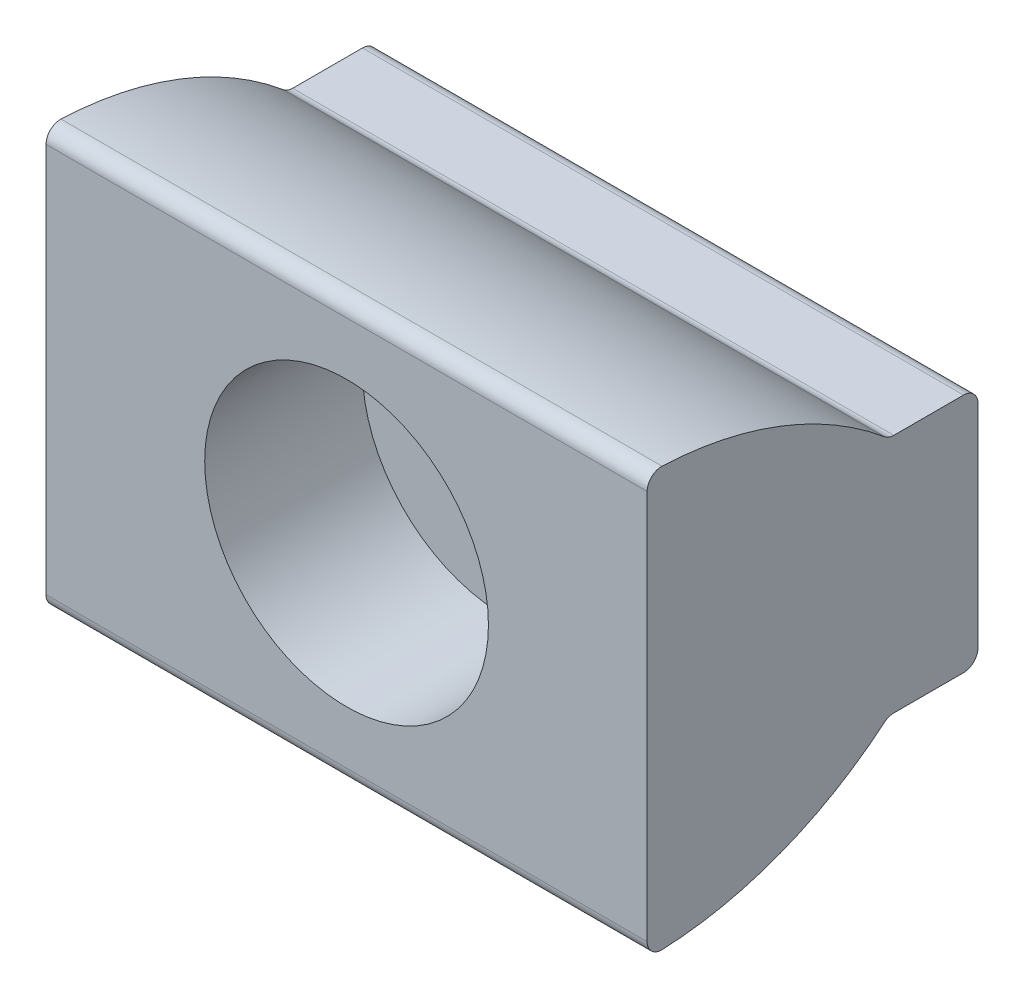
ISO-10303-21;
HEADER;
FILE_DESCRIPTION(('STEP AP214'),'2;1');
FILE_NAME('part.step','',(''),(''),'','','');
FILE_SCHEMA(('AUTOMOTIVE_DESIGN { 1 0 10303 214 1 1 1 1 }'));
ENDSEC;
DATA;
#1=APPLICATION_CONTEXT('core data for automotive mechanical design processes');
#2=APPLICATION_PROTOCOL_DEFINITION('international standard','automotive_design',2000,#1);
#3=PRODUCT_CONTEXT('',#1,'mechanical');
#4=PRODUCT('Part','Part','',(#3));
#5=PRODUCT_RELATED_PRODUCT_CATEGORY('part','',(#4));
#6=PRODUCT_DEFINITION_FORMATION('','',#4);
#7=PRODUCT_DEFINITION_CONTEXT('part definition',#1,'design');
#8=PRODUCT_DEFINITION('design','',#6,#7);
#9=PRODUCT_DEFINITION_SHAPE('','',#8);
#10=(LENGTH_UNIT() NAMED_UNIT(*) SI_UNIT(.MILLI.,.METRE.));
#11=(NAMED_UNIT(*) PLANE_ANGLE_UNIT() SI_UNIT($,.RADIAN.));
#12=(NAMED_UNIT(*) SI_UNIT($,.STERADIAN.) SOLID_ANGLE_UNIT());
#13=UNCERTAINTY_MEASURE_WITH_UNIT(LENGTH_MEASURE(1.E-05),#10,'distance_accuracy_value','');
#14=(GEOMETRIC_REPRESENTATION_CONTEXT(3) GLOBAL_UNCERTAINTY_ASSIGNED_CONTEXT((#13)) GLOBAL_UNIT_ASSIGNED_CONTEXT((#10,
#11,#12)) REPRESENTATION_CONTEXT('',''));
#15=CARTESIAN_POINT('',(0.,0.,0.));
#16=DIRECTION('',(0.,0.,1.));
#17=DIRECTION('',(1.,0.,0.));
#18=AXIS2_PLACEMENT_3D('',#15,#16,#17);
#19=CARTESIAN_POINT('',(7.9375,-2.794,0.));
#20=DIRECTION('',(0.,0.,1.));
#21=DIRECTION('',(1.,0.,0.));
#22=AXIS2_PLACEMENT_3D('',#19,#20,#21);
#23=PLANE('',#22);
#24=DIRECTION('',(0.,1.,0.));
#25=VECTOR('',#24,1.);
#26=CARTESIAN_POINT('',(-7.9375,-2.794,0.));
#27=LINE('',#26,#25);
#28=CARTESIAN_POINT('',(-7.9375,-2.794,0.));
#29=VERTEX_POINT('',#28);
#30=CARTESIAN_POINT('',(-7.9375,2.794,0.));
#31=VERTEX_POINT('',#30);
#32=EDGE_CURVE('E135',#29,#31,#27,.T.);
#33=ORIENTED_EDGE('',*,*,#32,.T.);
#34=DIRECTION('',(-1.,0.,0.));
#35=VECTOR('',#34,1.);
#36=CARTESIAN_POINT('',(7.9375,2.794,0.));
#37=LINE('',#36,#35);
#38=CARTESIAN_POINT('',(7.9375,2.794,0.));
#39=VERTEX_POINT('',#38);
#40=EDGE_CURVE('E186',#39,#31,#37,.T.);
#41=ORIENTED_EDGE('',*,*,#40,.F.);
#42=DIRECTION('',(0.,1.,0.));
#43=VECTOR('',#42,1.);
#44=CARTESIAN_POINT('',(7.9375,-2.794,0.));
#45=LINE('',#44,#43);
#46=CARTESIAN_POINT('',(7.9375,-2.794,0.));
#47=VERTEX_POINT('',#46);
#48=EDGE_CURVE('E158',#47,#39,#45,.T.);
#49=ORIENTED_EDGE('',*,*,#48,.F.);
#50=DIRECTION('',(-1.,0.,0.));
#51=VECTOR('',#50,1.);
#52=CARTESIAN_POINT('',(7.9375,-2.794,0.));
#53=LINE('',#52,#51);
#54=EDGE_CURVE('E189',#47,#29,#53,.T.);
#55=ORIENTED_EDGE('',*,*,#54,.T.);
#56=EDGE_LOOP('',(#33,#41,#49,#55));
#57=FACE_BOUND('',#56,.T.);
#58=CARTESIAN_POINT('',(0.,0.,0.));
#59=DIRECTION('',(0.,0.,1.));
#60=DIRECTION('',(1.,0.,0.));
#61=AXIS2_PLACEMENT_3D('',#58,#59,#60);
#62=CIRCLE('',#61,2.1209);
#63=CARTESIAN_POINT('',(2.1209,0.,0.));
#64=VERTEX_POINT('',#63);
#65=EDGE_CURVE('E18',#64,#64,#62,.F.);
#66=ORIENTED_EDGE('',*,*,#65,.F.);
#67=EDGE_LOOP('',(#66));
#68=FACE_BOUND('',#67,.T.);
#69=ADVANCED_FACE('F14',(#57,#68),#23,.F.);
#70=CARTESIAN_POINT('',(7.9375,-5.14847834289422,8.7376));
#71=DIRECTION('',(0.,0.,-1.));
#72=DIRECTION('',(-1.,0.,0.));
#73=AXIS2_PLACEMENT_3D('',#70,#71,#72);
#74=PLANE('',#73);
#75=DIRECTION('',(0.,-1.,0.));
#76=VECTOR('',#75,1.);
#77=CARTESIAN_POINT('',(-7.9375,-5.14847834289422,8.7376));
#78=LINE('',#77,#76);
#79=CARTESIAN_POINT('',(-7.9375,5.14847834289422,8.7376));
#80=VERTEX_POINT('',#79);
#81=CARTESIAN_POINT('',(-7.9375,-5.14847834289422,8.7376));
#82=VERTEX_POINT('',#81);
#83=EDGE_CURVE('E147',#80,#82,#78,.T.);
#84=ORIENTED_EDGE('',*,*,#83,.T.);
#85=DIRECTION('',(-1.,0.,0.));
#86=VECTOR('',#85,1.);
#87=CARTESIAN_POINT('',(7.9375,-5.14847834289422,8.7376));
#88=LINE('',#87,#86);
#89=CARTESIAN_POINT('',(7.9375,-5.14847834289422,8.7376));
#90=VERTEX_POINT('',#89);
#91=EDGE_CURVE('E122',#90,#82,#88,.T.);
#92=ORIENTED_EDGE('',*,*,#91,.F.);
#93=DIRECTION('',(0.,-1.,0.));
#94=VECTOR('',#93,1.);
#95=CARTESIAN_POINT('',(7.9375,-5.14847834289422,8.7376));
#96=LINE('',#95,#94);
#97=CARTESIAN_POINT('',(7.9375,5.14847834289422,8.7376));
#98=VERTEX_POINT('',#97);
#99=EDGE_CURVE('E31',#98,#90,#96,.T.);
#100=ORIENTED_EDGE('',*,*,#99,.F.);
#101=DIRECTION('',(-1.,0.,0.));
#102=VECTOR('',#101,1.);
#103=CARTESIAN_POINT('',(7.9375,5.14847834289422,8.7376));
#104=LINE('',#103,#102);
#105=EDGE_CURVE('E171',#98,#80,#104,.T.);
#106=ORIENTED_EDGE('',*,*,#105,.T.);
#107=EDGE_LOOP('',(#84,#92,#100,#106));
#108=FACE_BOUND('',#107,.T.);
#109=CARTESIAN_POINT('',(0.,0.,8.7376));
#110=DIRECTION('',(0.,0.,-1.));
#111=DIRECTION('',(-1.,0.,0.));
#112=AXIS2_PLACEMENT_3D('',#109,#110,#111);
#113=CIRCLE('',#112,3.7465);
#114=CARTESIAN_POINT('',(-3.7465,0.,8.7376));
#115=VERTEX_POINT('',#114);
#116=EDGE_CURVE('E125',#115,#115,#113,.F.);
#117=ORIENTED_EDGE('',*,*,#116,.F.);
#118=EDGE_LOOP('',(#117));
#119=FACE_BOUND('',#118,.T.);
#120=ADVANCED_FACE('F224',(#108,#119),#74,.F.);
#121=CARTESIAN_POINT('',(7.9375,-5.14847834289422,8.3566));
#122=DIRECTION('',(-1.,0.,0.));
#123=DIRECTION('',(0.,-1.,0.));
#124=AXIS2_PLACEMENT_3D('',#121,#122,#123);
#125=CYLINDRICAL_SURFACE('',#124,0.381);
#126=CARTESIAN_POINT('',(-7.9375,-5.14847834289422,8.3566));
#127=DIRECTION('',(1.,0.,0.));
#128=DIRECTION('',(0.,-1.,0.));
#129=AXIS2_PLACEMENT_3D('',#126,#127,#128);
#130=CIRCLE('',#129,0.381);
#131=CARTESIAN_POINT('',(-7.9375,-5.52916548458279,8.34116302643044));
#132=VERTEX_POINT('',#131);
#133=EDGE_CURVE('E109',#82,#132,#130,.T.);
#134=ORIENTED_EDGE('',*,*,#133,.T.);
#135=DIRECTION('',(-1.,0.,0.));
#136=VECTOR('',#135,1.);
#137=CARTESIAN_POINT('',(7.9375,-5.52916548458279,8.34116302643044));
#138=LINE('',#137,#136);
#139=CARTESIAN_POINT('',(7.9375,-5.52916548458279,8.34116302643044));
#140=VERTEX_POINT('',#139);
#141=EDGE_CURVE('E9',#140,#132,#138,.T.);
#142=ORIENTED_EDGE('',*,*,#141,.F.);
#143=CARTESIAN_POINT('',(7.9375,-5.14847834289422,8.3566));
#144=DIRECTION('',(1.,0.,0.));
#145=DIRECTION('',(0.,-1.,0.));
#146=AXIS2_PLACEMENT_3D('',#143,#144,#145);
#147=CIRCLE('',#146,0.381);
#148=EDGE_CURVE('E149',#90,#140,#147,.T.);
#149=ORIENTED_EDGE('',*,*,#148,.F.);
#150=ORIENTED_EDGE('',*,*,#91,.T.);
#151=EDGE_LOOP('',(#134,#142,#149,#150));
#152=FACE_BOUND('',#151,.T.);
#153=ADVANCED_FACE('F16',(#152),#125,.T.);
#154=CARTESIAN_POINT('',(7.9375,4.2472623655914,8.7376));
#155=DIRECTION('',(-1.,0.,0.));
#156=DIRECTION('',(0.,-1.,0.));
#157=AXIS2_PLACEMENT_3D('',#154,#155,#156);
#158=CYLINDRICAL_SURFACE('',#157,9.7844623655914);
#159=CARTESIAN_POINT('',(-7.9375,4.2472623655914,8.7376));
#160=DIRECTION('',(1.,0.,0.));
#161=DIRECTION('',(0.,1.,0.));
#162=AXIS2_PLACEMENT_3D('',#159,#160,#161);
#163=CIRCLE('',#162,9.7844623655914);
#164=CARTESIAN_POINT('',(-7.9375,-3.26353490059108,2.46674453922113));
#165=VERTEX_POINT('',#164);
#166=EDGE_CURVE('E105',#132,#165,#163,.T.);
#167=ORIENTED_EDGE('',*,*,#166,.T.);
#168=DIRECTION('',(-1.,0.,0.));
#169=VECTOR('',#168,1.);
#170=CARTESIAN_POINT('',(7.9375,-3.26353490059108,2.46674453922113));
#171=LINE('',#170,#169);
#172=CARTESIAN_POINT('',(7.9375,-3.26353490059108,2.46674453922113));
#173=VERTEX_POINT('',#172);
#174=EDGE_CURVE('E23',#173,#165,#171,.T.);
#175=ORIENTED_EDGE('',*,*,#174,.F.);
#176=CARTESIAN_POINT('',(7.9375,4.2472623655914,8.7376));
#177=DIRECTION('',(1.,0.,0.));
#178=DIRECTION('',(0.,1.,0.));
#179=AXIS2_PLACEMENT_3D('',#176,#177,#178);
#180=CIRCLE('',#179,9.7844623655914);
#181=EDGE_CURVE('E118',#140,#173,#180,.T.);
#182=ORIENTED_EDGE('',*,*,#181,.F.);
#183=ORIENTED_EDGE('',*,*,#141,.T.);
#184=EDGE_LOOP('',(#167,#175,#182,#183));
#185=FACE_BOUND('',#184,.T.);
#186=ADVANCED_FACE('F117',(#185),#158,.T.);
#187=CARTESIAN_POINT('',(7.9375,-3.556,2.22256189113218));
#188=DIRECTION('',(-1.,0.,0.));
#189=DIRECTION('',(0.,-1.,0.));
#190=AXIS2_PLACEMENT_3D('',#187,#188,#189);
#191=CYLINDRICAL_SURFACE('',#190,0.381);
#192=CARTESIAN_POINT('',(-7.9375,-3.556,2.22256189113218));
#193=DIRECTION('',(-1.,0.,0.));
#194=DIRECTION('',(0.,-1.,0.));
#195=AXIS2_PLACEMENT_3D('',#192,#193,#194);
#196=CIRCLE('',#195,0.381);
#197=CARTESIAN_POINT('',(-7.9375,-3.175,2.22256189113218));
#198=VERTEX_POINT('',#197);
#199=EDGE_CURVE('E111',#165,#198,#196,.T.);
#200=ORIENTED_EDGE('',*,*,#199,.T.);
#201=DIRECTION('',(-1.,0.,0.));
#202=VECTOR('',#201,1.);
#203=CARTESIAN_POINT('',(7.9375,-3.175,2.22256189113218));
#204=LINE('',#203,#202);
#205=CARTESIAN_POINT('',(7.9375,-3.175,2.22256189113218));
#206=VERTEX_POINT('',#205);
#207=EDGE_CURVE('E195',#206,#198,#204,.T.);
#208=ORIENTED_EDGE('',*,*,#207,.F.);
#209=CARTESIAN_POINT('',(7.9375,-3.556,2.22256189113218));
#210=DIRECTION('',(-1.,0.,0.));
#211=DIRECTION('',(0.,-1.,0.));
#212=AXIS2_PLACEMENT_3D('',#209,#210,#211);
#213=CIRCLE('',#212,0.381);
#214=EDGE_CURVE('E152',#173,#206,#213,.T.);
#215=ORIENTED_EDGE('',*,*,#214,.F.);
#216=ORIENTED_EDGE('',*,*,#174,.T.);
#217=EDGE_LOOP('',(#200,#208,#215,#216));
#218=FACE_BOUND('',#217,.T.);
#219=ADVANCED_FACE('F245',(#218),#191,.F.);
#220=CARTESIAN_POINT('',(7.9375,-3.175,0.381));
#221=DIRECTION('',(0.,1.,0.));
#222=DIRECTION('',(0.,0.,1.));
#223=AXIS2_PLACEMENT_3D('',#220,#221,#222);
#224=PLANE('',#223);
#225=DIRECTION('',(0.,0.,-1.));
#226=VECTOR('',#225,1.);
#227=CARTESIAN_POINT('',(-7.9375,-3.175,0.381));
#228=LINE('',#227,#226);
#229=CARTESIAN_POINT('',(-7.9375,-3.175,0.381));
#230=VERTEX_POINT('',#229);
#231=EDGE_CURVE('E131',#198,#230,#228,.T.);
#232=ORIENTED_EDGE('',*,*,#231,.T.);
#233=DIRECTION('',(-1.,0.,0.));
#234=VECTOR('',#233,1.);
#235=CARTESIAN_POINT('',(7.9375,-3.175,0.381));
#236=LINE('',#235,#234);
#237=CARTESIAN_POINT('',(7.9375,-3.175,0.381));
#238=VERTEX_POINT('',#237);
#239=EDGE_CURVE('E192',#238,#230,#236,.T.);
#240=ORIENTED_EDGE('',*,*,#239,.F.);
#241=DIRECTION('',(0.,0.,-1.));
#242=VECTOR('',#241,1.);
#243=CARTESIAN_POINT('',(7.9375,-3.175,0.381));
#244=LINE('',#243,#242);
#245=EDGE_CURVE('E154',#206,#238,#244,.T.);
#246=ORIENTED_EDGE('',*,*,#245,.F.);
#247=ORIENTED_EDGE('',*,*,#207,.T.);
#248=EDGE_LOOP('',(#232,#240,#246,#247));
#249=FACE_BOUND('',#248,.T.);
#250=ADVANCED_FACE('F241',(#249),#224,.F.);
#251=CARTESIAN_POINT('',(7.9375,-2.794,0.381));
#252=DIRECTION('',(-1.,0.,0.));
#253=DIRECTION('',(0.,-1.,0.));
#254=AXIS2_PLACEMENT_3D('',#251,#252,#253);
#255=CYLINDRICAL_SURFACE('',#254,0.381);
#256=CARTESIAN_POINT('',(-7.9375,-2.794,0.381));
#257=DIRECTION('',(1.,0.,0.));
#258=DIRECTION('',(0.,1.,0.));
#259=AXIS2_PLACEMENT_3D('',#256,#257,#258);
#260=CIRCLE('',#259,0.381);
#261=EDGE_CURVE('E133',#230,#29,#260,.T.);
#262=ORIENTED_EDGE('',*,*,#261,.T.);
#263=ORIENTED_EDGE('',*,*,#54,.F.);
#264=CARTESIAN_POINT('',(7.9375,-2.794,0.381));
#265=DIRECTION('',(1.,0.,0.));
#266=DIRECTION('',(0.,1.,0.));
#267=AXIS2_PLACEMENT_3D('',#264,#265,#266);
#268=CIRCLE('',#267,0.381);
#269=EDGE_CURVE('E156',#238,#47,#268,.T.);
#270=ORIENTED_EDGE('',*,*,#269,.F.);
#271=ORIENTED_EDGE('',*,*,#239,.T.);
#272=EDGE_LOOP('',(#262,#263,#270,#271));
#273=FACE_BOUND('',#272,.T.);
#274=ADVANCED_FACE('F238',(#273),#255,.T.);
#275=CARTESIAN_POINT('',(7.9375,2.794,0.381));
#276=DIRECTION('',(-1.,0.,0.));
#277=DIRECTION('',(0.,-1.,0.));
#278=AXIS2_PLACEMENT_3D('',#275,#276,#277);
#279=CYLINDRICAL_SURFACE('',#278,0.381);
#280=CARTESIAN_POINT('',(-7.9375,2.794,0.381));
#281=DIRECTION('',(1.,0.,0.));
#282=DIRECTION('',(0.,1.,0.));
#283=AXIS2_PLACEMENT_3D('',#280,#281,#282);
#284=CIRCLE('',#283,0.381);
#285=CARTESIAN_POINT('',(-7.9375,3.175,0.381));
#286=VERTEX_POINT('',#285);
#287=EDGE_CURVE('E137',#31,#286,#284,.T.);
#288=ORIENTED_EDGE('',*,*,#287,.T.);
#289=DIRECTION('',(-1.,0.,0.));
#290=VECTOR('',#289,1.);
#291=CARTESIAN_POINT('',(7.9375,3.175,0.381));
#292=LINE('',#291,#290);
#293=CARTESIAN_POINT('',(7.9375,3.175,0.381));
#294=VERTEX_POINT('',#293);
#295=EDGE_CURVE('E183',#294,#286,#292,.T.);
#296=ORIENTED_EDGE('',*,*,#295,.F.);
#297=CARTESIAN_POINT('',(7.9375,2.794,0.381));
#298=DIRECTION('',(1.,0.,0.));
#299=DIRECTION('',(0.,1.,0.));
#300=AXIS2_PLACEMENT_3D('',#297,#298,#299);
#301=CIRCLE('',#300,0.381);
#302=EDGE_CURVE('E160',#39,#294,#301,.T.);
#303=ORIENTED_EDGE('',*,*,#302,.F.);
#304=ORIENTED_EDGE('',*,*,#40,.T.);
#305=EDGE_LOOP('',(#288,#296,#303,#304));
#306=FACE_BOUND('',#305,.T.);
#307=ADVANCED_FACE('F236',(#306),#279,.T.);
#308=CARTESIAN_POINT('',(7.9375,3.175,0.381));
#309=DIRECTION('',(0.,-1.,0.));
#310=DIRECTION('',(0.,0.,-1.));
#311=AXIS2_PLACEMENT_3D('',#308,#309,#310);
#312=PLANE('',#311);
#313=DIRECTION('',(0.,0.,1.));
#314=VECTOR('',#313,1.);
#315=CARTESIAN_POINT('',(-7.9375,3.175,0.381));
#316=LINE('',#315,#314);
#317=CARTESIAN_POINT('',(-7.9375,3.175,2.22256189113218));
#318=VERTEX_POINT('',#317);
#319=EDGE_CURVE('E139',#286,#318,#316,.T.);
#320=ORIENTED_EDGE('',*,*,#319,.T.);
#321=DIRECTION('',(-1.,0.,0.));
#322=VECTOR('',#321,1.);
#323=CARTESIAN_POINT('',(7.9375,3.175,2.22256189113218));
#324=LINE('',#323,#322);
#325=CARTESIAN_POINT('',(7.9375,3.175,2.22256189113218));
#326=VERTEX_POINT('',#325);
#327=EDGE_CURVE('E180',#326,#318,#324,.T.);
#328=ORIENTED_EDGE('',*,*,#327,.F.);
#329=DIRECTION('',(0.,0.,1.));
#330=VECTOR('',#329,1.);
#331=CARTESIAN_POINT('',(7.9375,3.175,0.381));
#332=LINE('',#331,#330);
#333=EDGE_CURVE('E162',#294,#326,#332,.T.);
#334=ORIENTED_EDGE('',*,*,#333,.F.);
#335=ORIENTED_EDGE('',*,*,#295,.T.);
#336=EDGE_LOOP('',(#320,#328,#334,#335));
#337=FACE_BOUND('',#336,.T.);
#338=ADVANCED_FACE('F303',(#337),#312,.F.);
#339=CARTESIAN_POINT('',(7.9375,3.556,2.22256189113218));
#340=DIRECTION('',(-1.,0.,0.));
#341=DIRECTION('',(0.,-1.,0.));
#342=AXIS2_PLACEMENT_3D('',#339,#340,#341);
#343=CYLINDRICAL_SURFACE('',#342,0.381);
#344=CARTESIAN_POINT('',(-7.9375,3.556,2.22256189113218));
#345=DIRECTION('',(-1.,0.,0.));
#346=DIRECTION('',(0.,-1.,0.));
#347=AXIS2_PLACEMENT_3D('',#344,#345,#346);
#348=CIRCLE('',#347,0.381);
#349=CARTESIAN_POINT('',(-7.9375,3.26353490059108,2.46674453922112));
#350=VERTEX_POINT('',#349);
#351=EDGE_CURVE('E141',#318,#350,#348,.T.);
#352=ORIENTED_EDGE('',*,*,#351,.T.);
#353=DIRECTION('',(-1.,0.,0.));
#354=VECTOR('',#353,1.);
#355=CARTESIAN_POINT('',(7.9375,3.26353490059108,2.46674453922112));
#356=LINE('',#355,#354);
#357=CARTESIAN_POINT('',(7.9375,3.26353490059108,2.46674453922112));
#358=VERTEX_POINT('',#357);
#359=EDGE_CURVE('E177',#358,#350,#356,.T.);
#360=ORIENTED_EDGE('',*,*,#359,.F.);
#361=CARTESIAN_POINT('',(7.9375,3.556,2.22256189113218));
#362=DIRECTION('',(-1.,0.,0.));
#363=DIRECTION('',(0.,-1.,0.));
#364=AXIS2_PLACEMENT_3D('',#361,#362,#363);
#365=CIRCLE('',#364,0.381);
#366=EDGE_CURVE('E164',#326,#358,#365,.T.);
#367=ORIENTED_EDGE('',*,*,#366,.F.);
#368=ORIENTED_EDGE('',*,*,#327,.T.);
#369=EDGE_LOOP('',(#352,#360,#367,#368));
#370=FACE_BOUND('',#369,.T.);
#371=ADVANCED_FACE('F310',(#370),#343,.F.);
#372=CARTESIAN_POINT('',(7.9375,-4.2472623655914,8.7376));
#373=DIRECTION('',(-1.,0.,0.));
#374=DIRECTION('',(0.,-1.,0.));
#375=AXIS2_PLACEMENT_3D('',#372,#373,#374);
#376=CYLINDRICAL_SURFACE('',#375,9.7844623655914);
#377=CARTESIAN_POINT('',(-7.9375,-4.2472623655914,8.7376));
#378=DIRECTION('',(1.,0.,0.));
#379=DIRECTION('',(0.,-1.,0.));
#380=AXIS2_PLACEMENT_3D('',#377,#378,#379);
#381=CIRCLE('',#380,9.7844623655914);
#382=CARTESIAN_POINT('',(-7.9375,5.52916548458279,8.34116302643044));
#383=VERTEX_POINT('',#382);
#384=EDGE_CURVE('E143',#350,#383,#381,.T.);
#385=ORIENTED_EDGE('',*,*,#384,.T.);
#386=DIRECTION('',(-1.,0.,0.));
#387=VECTOR('',#386,1.);
#388=CARTESIAN_POINT('',(7.9375,5.52916548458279,8.34116302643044));
#389=LINE('',#388,#387);
#390=CARTESIAN_POINT('',(7.9375,5.52916548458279,8.34116302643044));
#391=VERTEX_POINT('',#390);
#392=EDGE_CURVE('E174',#391,#383,#389,.T.);
#393=ORIENTED_EDGE('',*,*,#392,.F.);
#394=CARTESIAN_POINT('',(7.9375,-4.2472623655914,8.7376));
#395=DIRECTION('',(1.,0.,0.));
#396=DIRECTION('',(0.,-1.,0.));
#397=AXIS2_PLACEMENT_3D('',#394,#395,#396);
#398=CIRCLE('',#397,9.7844623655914);
#399=EDGE_CURVE('E166',#358,#391,#398,.T.);
#400=ORIENTED_EDGE('',*,*,#399,.F.);
#401=ORIENTED_EDGE('',*,*,#359,.T.);
#402=EDGE_LOOP('',(#385,#393,#400,#401));
#403=FACE_BOUND('',#402,.T.);
#404=ADVANCED_FACE('F318',(#403),#376,.T.);
#405=CARTESIAN_POINT('',(7.9375,5.14847834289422,8.3566));
#406=DIRECTION('',(-1.,0.,0.));
#407=DIRECTION('',(0.,-1.,0.));
#408=AXIS2_PLACEMENT_3D('',#405,#406,#407);
#409=CYLINDRICAL_SURFACE('',#408,0.381);
#410=CARTESIAN_POINT('',(-7.9375,5.14847834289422,8.3566));
#411=DIRECTION('',(1.,0.,0.));
#412=DIRECTION('',(0.,-1.,0.));
#413=AXIS2_PLACEMENT_3D('',#410,#411,#412);
#414=CIRCLE('',#413,0.381);
#415=EDGE_CURVE('E145',#383,#80,#414,.T.);
#416=ORIENTED_EDGE('',*,*,#415,.T.);
#417=ORIENTED_EDGE('',*,*,#105,.F.);
#418=CARTESIAN_POINT('',(7.9375,5.14847834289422,8.3566));
#419=DIRECTION('',(1.,0.,0.));
#420=DIRECTION('',(0.,-1.,0.));
#421=AXIS2_PLACEMENT_3D('',#418,#419,#420);
#422=CIRCLE('',#421,0.381);
#423=EDGE_CURVE('E36',#391,#98,#422,.T.);
#424=ORIENTED_EDGE('',*,*,#423,.F.);
#425=ORIENTED_EDGE('',*,*,#392,.T.);
#426=EDGE_LOOP('',(#416,#417,#424,#425));
#427=FACE_BOUND('',#426,.T.);
#428=ADVANCED_FACE('F327',(#427),#409,.T.);
#429=CARTESIAN_POINT('',(7.9375,-5.14847834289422,8.3566));
#430=DIRECTION('',(-1.,0.,0.));
#431=DIRECTION('',(0.,-1.,0.));
#432=AXIS2_PLACEMENT_3D('',#429,#430,#431);
#433=PLANE('',#432);
#434=ORIENTED_EDGE('',*,*,#148,.T.);
#435=ORIENTED_EDGE('',*,*,#181,.T.);
#436=ORIENTED_EDGE('',*,*,#214,.T.);
#437=ORIENTED_EDGE('',*,*,#245,.T.);
#438=ORIENTED_EDGE('',*,*,#269,.T.);
#439=ORIENTED_EDGE('',*,*,#48,.T.);
#440=ORIENTED_EDGE('',*,*,#302,.T.);
#441=ORIENTED_EDGE('',*,*,#333,.T.);
#442=ORIENTED_EDGE('',*,*,#366,.T.);
#443=ORIENTED_EDGE('',*,*,#399,.T.);
#444=ORIENTED_EDGE('',*,*,#423,.T.);
#445=ORIENTED_EDGE('',*,*,#99,.T.);
#446=EDGE_LOOP('',(#434,#435,#436,#437,#438,#439,#440,#441,#442,#443,#444,#445));
#447=FACE_BOUND('',#446,.T.);
#448=ADVANCED_FACE('F336',(#447),#433,.F.);
#449=CARTESIAN_POINT('',(-7.9375,-5.14847834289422,8.3566));
#450=DIRECTION('',(-1.,0.,0.));
#451=DIRECTION('',(0.,-1.,0.));
#452=AXIS2_PLACEMENT_3D('',#449,#450,#451);
#453=PLANE('',#452);
#454=ORIENTED_EDGE('',*,*,#133,.F.);
#455=ORIENTED_EDGE('',*,*,#83,.F.);
#456=ORIENTED_EDGE('',*,*,#415,.F.);
#457=ORIENTED_EDGE('',*,*,#384,.F.);
#458=ORIENTED_EDGE('',*,*,#351,.F.);
#459=ORIENTED_EDGE('',*,*,#319,.F.);
#460=ORIENTED_EDGE('',*,*,#287,.F.);
#461=ORIENTED_EDGE('',*,*,#32,.F.);
#462=ORIENTED_EDGE('',*,*,#261,.F.);
#463=ORIENTED_EDGE('',*,*,#231,.F.);
#464=ORIENTED_EDGE('',*,*,#199,.F.);
#465=ORIENTED_EDGE('',*,*,#166,.F.);
#466=EDGE_LOOP('',(#454,#455,#456,#457,#458,#459,#460,#461,#462,#463,#464,#465));
#467=FACE_BOUND('',#466,.T.);
#468=ADVANCED_FACE('F106',(#467),#453,.T.);
#469=CARTESIAN_POINT('',(0.,0.,25.2235199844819));
#470=DIRECTION('',(0.,0.,1.));
#471=DIRECTION('',(1.,0.,0.));
#472=AXIS2_PLACEMENT_3D('',#469,#470,#471);
#473=CYLINDRICAL_SURFACE('',#472,2.1209);
#474=CARTESIAN_POINT('',(0.,0.,4.572));
#475=DIRECTION('',(0.,0.,1.));
#476=DIRECTION('',(1.,0.,0.));
#477=AXIS2_PLACEMENT_3D('',#474,#475,#476);
#478=CIRCLE('',#477,2.1209);
#479=CARTESIAN_POINT('',(2.1209,0.,4.572));
#480=VERTEX_POINT('',#479);
#481=EDGE_CURVE('E127',#480,#480,#478,.T.);
#482=ORIENTED_EDGE('',*,*,#481,.T.);
#483=EDGE_LOOP('',(#482));
#484=FACE_BOUND('',#483,.T.);
#485=ORIENTED_EDGE('',*,*,#65,.T.);
#486=EDGE_LOOP('',(#485));
#487=FACE_BOUND('',#486,.T.);
#488=ADVANCED_FACE('F213',(#484,#487),#473,.F.);
#489=CARTESIAN_POINT('',(0.,0.,25.2235199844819));
#490=DIRECTION('',(0.,0.,1.));
#491=DIRECTION('',(1.,0.,0.));
#492=AXIS2_PLACEMENT_3D('',#489,#490,#491);
#493=CYLINDRICAL_SURFACE('',#492,3.7465);
#494=CARTESIAN_POINT('',(0.,0.,4.572));
#495=DIRECTION('',(0.,0.,1.));
#496=DIRECTION('',(1.,0.,0.));
#497=AXIS2_PLACEMENT_3D('',#494,#495,#496);
#498=CIRCLE('',#497,3.7465);
#499=CARTESIAN_POINT('',(3.7465,0.,4.572));
#500=VERTEX_POINT('',#499);
#501=EDGE_CURVE('E202',#500,#500,#498,.T.);
#502=ORIENTED_EDGE('',*,*,#501,.F.);
#503=EDGE_LOOP('',(#502));
#504=FACE_BOUND('',#503,.T.);
#505=ORIENTED_EDGE('',*,*,#116,.T.);
#506=EDGE_LOOP('',(#505));
#507=FACE_BOUND('',#506,.T.);
#508=ADVANCED_FACE('F211',(#504,#507),#493,.F.);
#509=CARTESIAN_POINT('',(0.,2.1209,4.572));
#510=DIRECTION('',(0.,0.,1.));
#511=DIRECTION('',(1.,0.,0.));
#512=AXIS2_PLACEMENT_3D('',#509,#510,#511);
#513=PLANE('',#512);
#514=ORIENTED_EDGE('',*,*,#501,.T.);
#515=EDGE_LOOP('',(#514));
#516=FACE_BOUND('',#515,.T.);
#517=ORIENTED_EDGE('',*,*,#481,.F.);
#518=EDGE_LOOP('',(#517));
#519=FACE_BOUND('',#518,.T.);
#520=ADVANCED_FACE('F208',(#516,#519),#513,.T.);
#521=CLOSED_SHELL('',(#69,#120,#153,#186,#219,#250,#274,#307,#338,#371,#404,#428,#448,#468,#488,
#508,#520));
#522=MANIFOLD_SOLID_BREP('B1',#521);
#523=ADVANCED_BREP_SHAPE_REPRESENTATION('',(#18,#522),#14);
#524=SHAPE_DEFINITION_REPRESENTATION(#9,#523);
ENDSEC;
END-ISO-10303-21;
